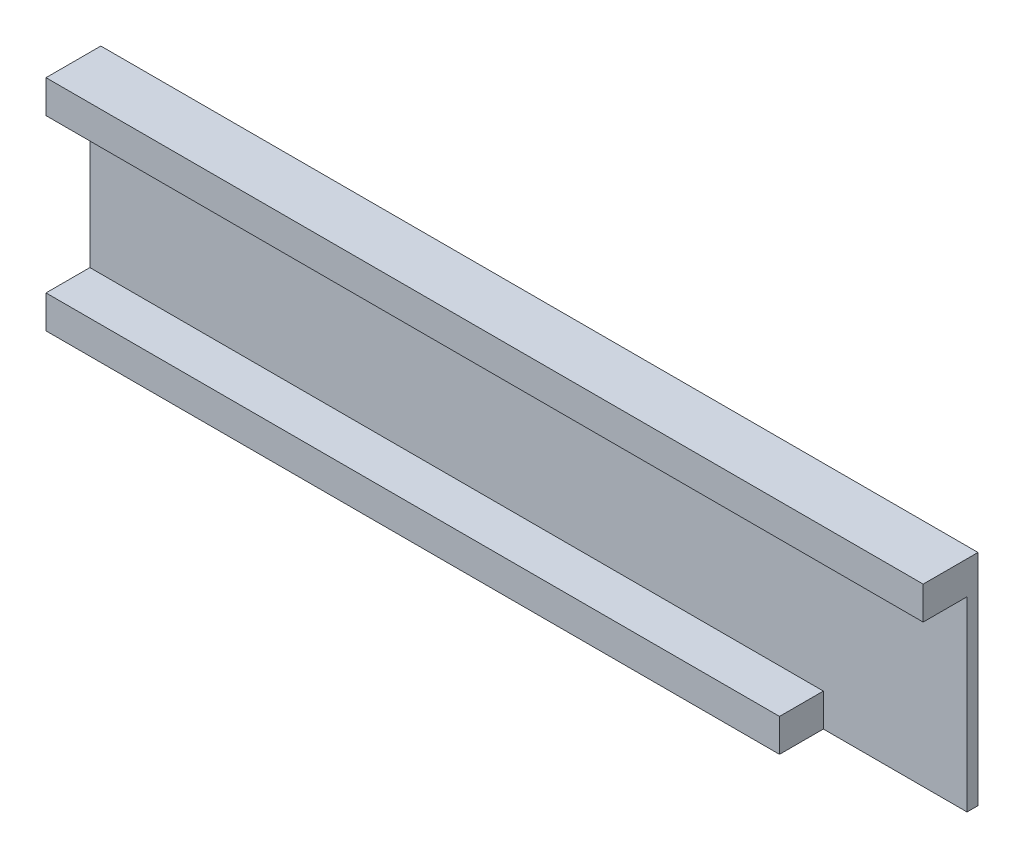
from build123d import *

# Parameters (mm, degrees)
SKETCH_1_W          = 40
SKETCH_1_H          = 10
EXTRUDE_1_DEPTH     = 0.5
EXTRUDE_2_DEPTH     = 1.475402
SKETCH_3_W          = 40
SKETCH_3_H          = 2.5
SKETCH_3_W_2        = 33.449029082
EXTRUDE_3_DEPTH     = 2
CUT_EXTRUDE_1_DEPTH = 1.475402
SKETCH_5_W          = 40
SKETCH_5_H          = 1
SKETCH_5_W_2        = 33.449029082
CUT_EXTRUDE_2_DEPTH = 27.429094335


with BuildPart() as part:
    # Sketch 1 → Extrude 1 (new body)
    with BuildSketch(Plane.XY):
        with Locations((5.724137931, 0.724137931)):
            Rectangle(SKETCH_1_W, SKETCH_1_H)
    extrude(amount=EXTRUDE_1_DEPTH)

    # Sketch 2 → Extrude 2 (add)
    with BuildSketch(Plane(origin=(0, 0, 0), x_dir=(-1, 0, 0), z_dir=(0, 0, -1))):
        Polygon((-24.086961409, 0.009317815), (7.77963716, 0.171843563), (12.525401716, 2.546287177), (-19.016359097, 2.546287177), align=None)
    extrude(amount=EXTRUDE_2_DEPTH)

    # Sketch 3 → Extrude 3 (add)
    with BuildSketch(Plane.XY.offset(0.5)):
        with Locations((5.724137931, 4.474137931)):
            Rectangle(SKETCH_3_W, SKETCH_3_H)
        with Locations((2.448652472, -3.025862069)):
            Rectangle(SKETCH_3_W_2, SKETCH_3_H)
    extrude(amount=EXTRUDE_3_DEPTH)

    # Sketch 4 → Cut-Extrude 1 (cut)
    with BuildSketch(Plane(origin=(0, 0, -1.475401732), x_dir=(-1, 0, 0), z_dir=(0, 0, -1))):
        Polygon((-19.016359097, 2.546287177), (-24.086961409, 0.009317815), (7.77963716, 0.171843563), (12.525401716, 2.546287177), align=None)
        Polygon((-18.969117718, 2.346287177), (-23.231520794, 0.213683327), (7.731914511, 0.37160277), (11.678686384, 2.346287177), align=None, mode=Mode.SUBTRACT)
    extrude(amount=-CUT_EXTRUDE_1_DEPTH, mode=Mode.SUBTRACT)

    # Sketch 5 → Cut-Extrude 2 (cut, through all)
    with BuildSketch(Plane.XY.offset(0.5)):
        with Locations((5.724137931, 3.724137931)):
            Rectangle(SKETCH_5_W, SKETCH_5_H)
        with Locations((2.448652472, -2.275862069)):
            Rectangle(SKETCH_5_W_2, SKETCH_5_H)
    extrude(amount=CUT_EXTRUDE_2_DEPTH, mode=Mode.SUBTRACT)


solid = part.part
